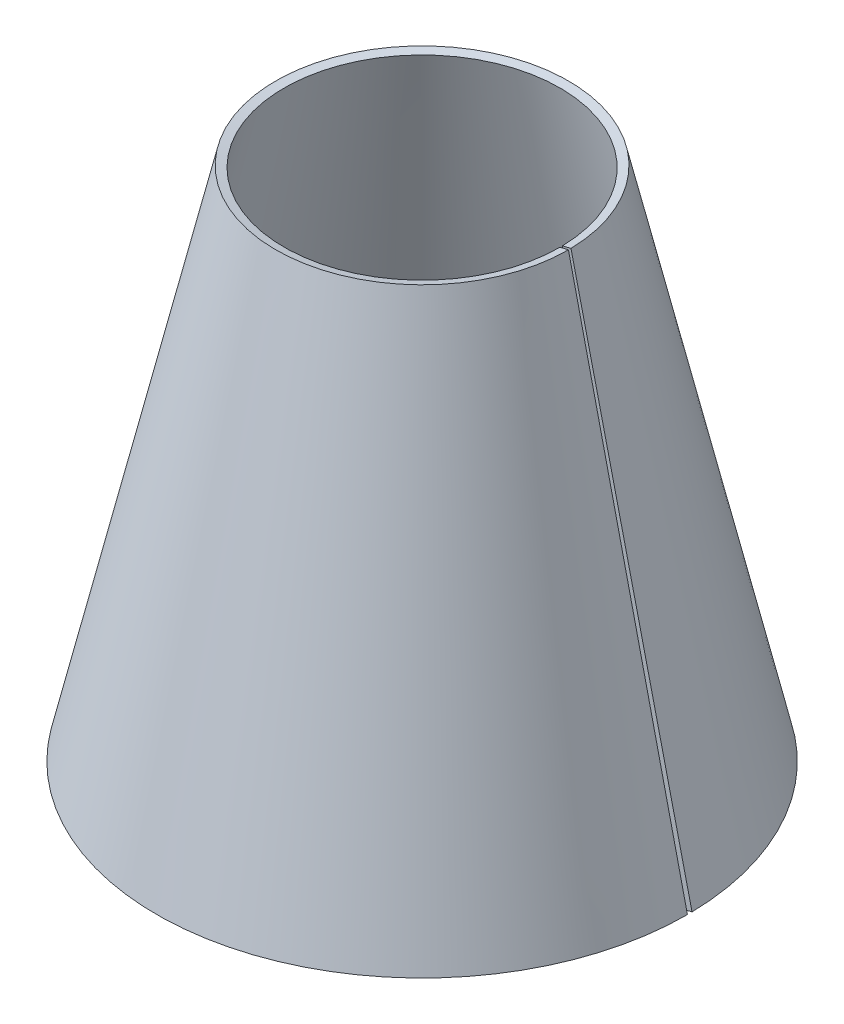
ISO-10303-21;
HEADER;
FILE_DESCRIPTION(('STEP AP214'),'2;1');
FILE_NAME('part.step','',(''),(''),'','','');
FILE_SCHEMA(('AUTOMOTIVE_DESIGN { 1 0 10303 214 1 1 1 1 }'));
ENDSEC;
DATA;
#1=APPLICATION_CONTEXT('core data for automotive mechanical design processes');
#2=APPLICATION_PROTOCOL_DEFINITION('international standard','automotive_design',2000,#1);
#3=PRODUCT_CONTEXT('',#1,'mechanical');
#4=PRODUCT('Part','Part','',(#3));
#5=PRODUCT_RELATED_PRODUCT_CATEGORY('part','',(#4));
#6=PRODUCT_DEFINITION_FORMATION('','',#4);
#7=PRODUCT_DEFINITION_CONTEXT('part definition',#1,'design');
#8=PRODUCT_DEFINITION('design','',#6,#7);
#9=PRODUCT_DEFINITION_SHAPE('','',#8);
#10=(LENGTH_UNIT() NAMED_UNIT(*) SI_UNIT(.MILLI.,.METRE.));
#11=(NAMED_UNIT(*) PLANE_ANGLE_UNIT() SI_UNIT($,.RADIAN.));
#12=(NAMED_UNIT(*) SI_UNIT($,.STERADIAN.) SOLID_ANGLE_UNIT());
#13=UNCERTAINTY_MEASURE_WITH_UNIT(LENGTH_MEASURE(1.E-05),#10,'distance_accuracy_value','');
#14=(GEOMETRIC_REPRESENTATION_CONTEXT(3) GLOBAL_UNCERTAINTY_ASSIGNED_CONTEXT((#13)) GLOBAL_UNIT_ASSIGNED_CONTEXT((#10,
#11,#12)) REPRESENTATION_CONTEXT('',''));
#15=CARTESIAN_POINT('',(0.,0.,0.));
#16=DIRECTION('',(0.,0.,1.));
#17=DIRECTION('',(1.,0.,0.));
#18=AXIS2_PLACEMENT_3D('',#15,#16,#17);
#19=CARTESIAN_POINT('',(17.0183400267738,60.0317269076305,0.));
#20=DIRECTION('',(0.,0.,1.));
#21=DIRECTION('',(0.224637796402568,-0.974442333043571,0.));
#22=AXIS2_PLACEMENT_3D('',#19,#20,#21);
#23=PLANE('',#22);
#24=DIRECTION('',(0.974442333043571,0.224637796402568,0.));
#25=VECTOR('',#24,1.);
#26=CARTESIAN_POINT('',(30.8574297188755,0.,0.));
#27=LINE('',#26,#25);
#28=CARTESIAN_POINT('',(29.8829873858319,-0.224637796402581,0.));
#29=VERTEX_POINT('',#28);
#30=CARTESIAN_POINT('',(30.8574297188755,0.,0.));
#31=VERTEX_POINT('',#30);
#32=EDGE_CURVE('E11',#29,#31,#27,.T.);
#33=ORIENTED_EDGE('',*,*,#32,.F.);
#34=DIRECTION('',(0.224637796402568,-0.974442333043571,0.));
#35=VECTOR('',#34,1.);
#36=CARTESIAN_POINT('',(200.066387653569,-738.452630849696,0.));
#37=LINE('',#36,#35);
#38=CARTESIAN_POINT('',(16.0438976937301,59.807089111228,0.));
#39=VERTEX_POINT('',#38);
#40=EDGE_CURVE('E86',#39,#29,#37,.T.);
#41=ORIENTED_EDGE('',*,*,#40,.F.);
#42=DIRECTION('',(0.974442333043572,0.224637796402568,0.));
#43=VECTOR('',#42,1.);
#44=CARTESIAN_POINT('',(17.0183400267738,60.0317269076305,0.));
#45=LINE('',#44,#43);
#46=CARTESIAN_POINT('',(17.0183400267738,60.0317269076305,0.));
#47=VERTEX_POINT('',#46);
#48=EDGE_CURVE('E41',#39,#47,#45,.T.);
#49=ORIENTED_EDGE('',*,*,#48,.T.);
#50=DIRECTION('',(0.224637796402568,-0.974442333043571,0.));
#51=VECTOR('',#50,1.);
#52=CARTESIAN_POINT('',(17.0183400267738,60.0317269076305,0.));
#53=LINE('',#52,#51);
#54=EDGE_CURVE('E93',#47,#31,#53,.T.);
#55=ORIENTED_EDGE('',*,*,#54,.T.);
#56=EDGE_LOOP('',(#33,#41,#49,#55));
#57=FACE_BOUND('',#56,.T.);
#58=ADVANCED_FACE('F32',(#57),#23,.F.);
#59=CARTESIAN_POINT('',(0.,60.0317269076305,0.));
#60=DIRECTION('',(0.,1.,0.));
#61=DIRECTION('',(0.,0.,1.));
#62=AXIS2_PLACEMENT_3D('',#59,#60,#61);
#63=CONICAL_SURFACE('',#62,17.0183400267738,1.34422501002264);
#64=ORIENTED_EDGE('',*,*,#48,.F.);
#65=CARTESIAN_POINT('',(0.,59.8070891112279,0.));
#66=DIRECTION('',(0.,-1.,0.));
#67=DIRECTION('',(0.,0.,-1.));
#68=AXIS2_PLACEMENT_3D('',#65,#66,#67);
#69=CIRCLE('',#68,16.0438976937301);
#70=CARTESIAN_POINT('',(16.041454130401,59.8070891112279,-0.280004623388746));
#71=VERTEX_POINT('',#70);
#72=EDGE_CURVE('E81',#71,#39,#69,.F.);
#73=ORIENTED_EDGE('',*,*,#72,.F.);
#74=DIRECTION('',(0.974293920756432,0.224637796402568,-0.0170063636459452));
#75=VECTOR('',#74,1.);
#76=CARTESIAN_POINT('',(17.0157480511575,60.0317269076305,-0.297010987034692));
#77=LINE('',#76,#75);
#78=CARTESIAN_POINT('',(17.0157480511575,60.0317269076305,-0.297010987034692));
#79=VERTEX_POINT('',#78);
#80=EDGE_CURVE('E70',#71,#79,#77,.T.);
#81=ORIENTED_EDGE('',*,*,#80,.T.);
#82=CARTESIAN_POINT('',(0.,60.0317269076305,0.));
#83=DIRECTION('',(0.,1.,0.));
#84=DIRECTION('',(0.,0.,1.));
#85=AXIS2_PLACEMENT_3D('',#82,#83,#84);
#86=CIRCLE('',#85,17.0183400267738);
#87=EDGE_CURVE('E91',#79,#47,#86,.T.);
#88=ORIENTED_EDGE('',*,*,#87,.T.);
#89=EDGE_LOOP('',(#64,#73,#81,#88));
#90=FACE_BOUND('',#89,.T.);
#91=ADVANCED_FACE('F82',(#90),#63,.F.);
#92=CARTESIAN_POINT('',(30.852729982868,0.,-0.538536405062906));
#93=DIRECTION('',(-0.0174524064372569,0.,-0.999847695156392));
#94=DIRECTION('',(-0.224603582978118,0.974442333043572,0.00392047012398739));
#95=AXIS2_PLACEMENT_3D('',#92,#93,#94);
#96=PLANE('',#95);
#97=ORIENTED_EDGE('',*,*,#80,.F.);
#98=DIRECTION('',(0.224603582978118,-0.974442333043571,-0.00392047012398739));
#99=VECTOR('',#98,1.);
#100=CARTESIAN_POINT('',(200.035916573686,-738.452630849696,-3.4916399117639));
#101=LINE('',#100,#99);
#102=CARTESIAN_POINT('',(29.8784360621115,-0.224637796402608,-0.521530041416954));
#103=VERTEX_POINT('',#102);
#104=EDGE_CURVE('E74',#103,#71,#101,.F.);
#105=ORIENTED_EDGE('',*,*,#104,.F.);
#106=DIRECTION('',(0.974293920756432,0.224637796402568,-0.0170063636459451));
#107=VECTOR('',#106,1.);
#108=CARTESIAN_POINT('',(30.852729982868,0.,-0.5385364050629));
#109=LINE('',#108,#107);
#110=CARTESIAN_POINT('',(30.852729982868,0.,-0.5385364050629));
#111=VERTEX_POINT('',#110);
#112=EDGE_CURVE('E36',#103,#111,#109,.T.);
#113=ORIENTED_EDGE('',*,*,#112,.T.);
#114=DIRECTION('',(-0.224603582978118,0.974442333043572,0.00392047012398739));
#115=VECTOR('',#114,1.);
#116=CARTESIAN_POINT('',(30.852729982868,0.,-0.538536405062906));
#117=LINE('',#116,#115);
#118=EDGE_CURVE('E75',#111,#79,#117,.T.);
#119=ORIENTED_EDGE('',*,*,#118,.T.);
#120=EDGE_LOOP('',(#97,#105,#113,#119));
#121=FACE_BOUND('',#120,.T.);
#122=ADVANCED_FACE('F72',(#121),#96,.F.);
#123=CARTESIAN_POINT('',(0.,0.,0.));
#124=DIRECTION('',(0.,1.,0.));
#125=DIRECTION('',(0.,0.,1.));
#126=AXIS2_PLACEMENT_3D('',#123,#124,#125);
#127=CONICAL_SURFACE('',#126,30.8574297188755,1.34422501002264);
#128=CARTESIAN_POINT('',(0.,-0.224637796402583,0.));
#129=DIRECTION('',(0.,-1.,0.));
#130=DIRECTION('',(0.,0.,-1.));
#131=AXIS2_PLACEMENT_3D('',#128,#129,#130);
#132=CIRCLE('',#131,29.8829873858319);
#133=EDGE_CURVE('E90',#29,#103,#132,.T.);
#134=ORIENTED_EDGE('',*,*,#133,.F.);
#135=ORIENTED_EDGE('',*,*,#32,.T.);
#136=CARTESIAN_POINT('',(0.,0.,0.));
#137=DIRECTION('',(0.,-1.,0.));
#138=DIRECTION('',(0.,0.,-1.));
#139=AXIS2_PLACEMENT_3D('',#136,#137,#138);
#140=CIRCLE('',#139,30.8574297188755);
#141=EDGE_CURVE('E99',#31,#111,#140,.T.);
#142=ORIENTED_EDGE('',*,*,#141,.T.);
#143=ORIENTED_EDGE('',*,*,#112,.F.);
#144=EDGE_LOOP('',(#134,#135,#142,#143));
#145=FACE_BOUND('',#144,.T.);
#146=ADVANCED_FACE('F34',(#145),#127,.T.);
#147=CARTESIAN_POINT('',(0.,-738.227993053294,0.));
#148=DIRECTION('',(0.,-1.,0.));
#149=DIRECTION('',(0.,0.,-1.));
#150=AXIS2_PLACEMENT_3D('',#147,#148,#149);
#151=CONICAL_SURFACE('',#150,201.040829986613,0.226571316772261);
#152=ORIENTED_EDGE('',*,*,#118,.F.);
#153=ORIENTED_EDGE('',*,*,#141,.F.);
#154=ORIENTED_EDGE('',*,*,#54,.F.);
#155=ORIENTED_EDGE('',*,*,#87,.F.);
#156=EDGE_LOOP('',(#152,#153,#154,#155));
#157=FACE_BOUND('',#156,.T.);
#158=ADVANCED_FACE('F106',(#157),#151,.T.);
#159=CARTESIAN_POINT('',(0.,-738.452630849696,0.));
#160=DIRECTION('',(0.,-1.,0.));
#161=DIRECTION('',(0.,0.,-1.));
#162=AXIS2_PLACEMENT_3D('',#159,#160,#161);
#163=CONICAL_SURFACE('',#162,200.066387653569,0.226571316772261);
#164=ORIENTED_EDGE('',*,*,#104,.T.);
#165=ORIENTED_EDGE('',*,*,#72,.T.);
#166=ORIENTED_EDGE('',*,*,#40,.T.);
#167=ORIENTED_EDGE('',*,*,#133,.T.);
#168=EDGE_LOOP('',(#164,#165,#166,#167));
#169=FACE_BOUND('',#168,.T.);
#170=ADVANCED_FACE('F89',(#169),#163,.F.);
#171=CLOSED_SHELL('',(#58,#91,#122,#146,#158,#170));
#172=MANIFOLD_SOLID_BREP('B2',#171);
#173=ADVANCED_BREP_SHAPE_REPRESENTATION('',(#18,#172),#14);
#174=SHAPE_DEFINITION_REPRESENTATION(#9,#173);
ENDSEC;
END-ISO-10303-21;
